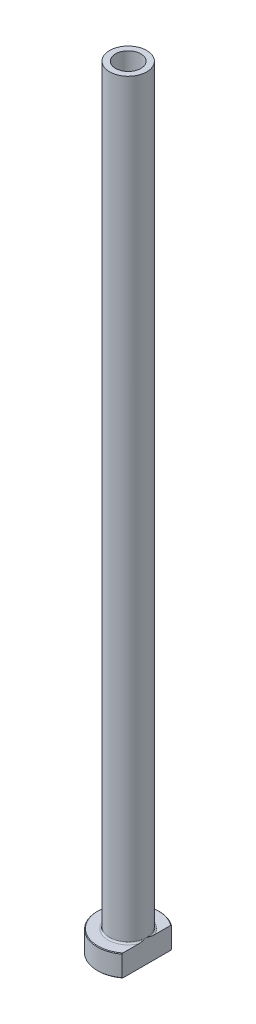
from build123d import *

# Parameters (mm, degrees)
FILLET1_R          = 0.5
CHAMFER1_SIZE      = 0.2
CUT_EXTRUDE1_DEPTH = 251.399680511
CHAMFER2_SIZE      = 0.5


with BuildPart() as part:
    # Sketch1 → Revolve1 (revolve)
    with BuildSketch(Plane.XY, mode=Mode.PRIVATE) as revolve1_sk:
        Polygon((-4.1, 250), (-6, 250), (-6, 7), (-10, 7), (-10, 0), (-4.35, 0), (-4.35, 193), (-4.1, 205), align=None)
    revolve(revolve1_sk.sketch.rotate(Axis((0, 92.187680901, 0), (0, -1, 0)), 270), axis=Axis((0, 92.187680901, 0), (0, -1, 0)))

    # Fillet1
    fillet1_edges = [part.edges().sort_by_distance(p)[0] for p in [
        (0, 7, -6),
    ]]
    fillet(fillet1_edges, radius=FILLET1_R)

    # Chamfer1
    chamfer1_edges = [part.edges().sort_by_distance(p)[0] for p in [
        (0, 0, -10),
        (0, 7, -10),
    ]]
    chamfer(chamfer1_edges, length=CHAMFER1_SIZE)

    # Sketch2 → Cut-Extrude1 (cut, through all)
    with BuildSketch(Plane.XZ):
        with BuildLine():
            Line((6, 8), (6, -8))
            ThreePointArc((6, -8), (10, 0), (6, 8))
        make_face()
    extrude(amount=-CUT_EXTRUDE1_DEPTH, mode=Mode.SUBTRACT)

    # Chamfer2
    chamfer2_edges = [part.edges().sort_by_distance(p)[0] for p in [
        (0, 0, -4.35),
    ]]
    chamfer(chamfer2_edges, length=CHAMFER2_SIZE)


solid = part.part
